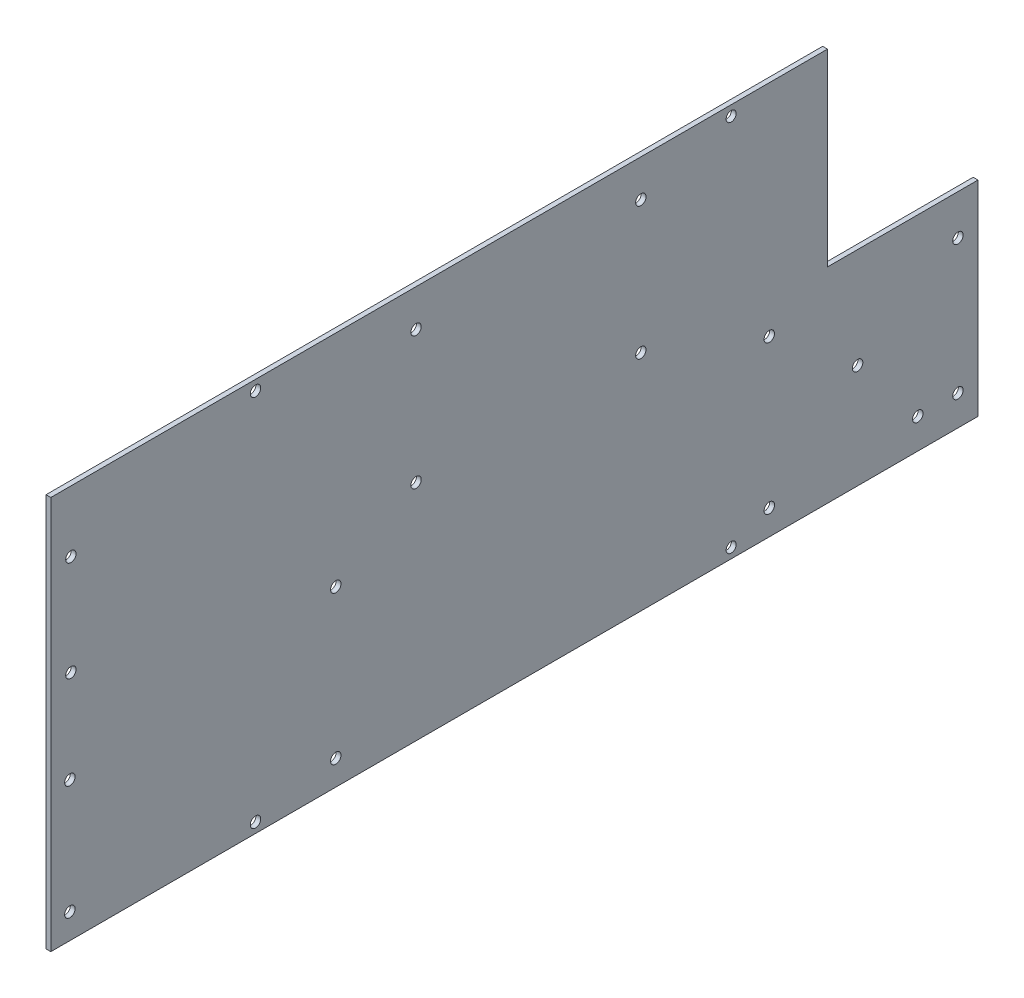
from build123d import *

# Parameters (mm, degrees)
SKETCH1_R          = 1.6383
SKETCH1_R_2        = 1.651
SKETCH1_R_3        = 1.5875
EXTRUDE1_DEPTH     = 1.524
SKETCH2_R          = 1.651
CUT_EXTRUDE1_DEPTH = 261.289404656


with BuildPart() as part:
    # Sketch1 → Extrude1 (new body)
    with BuildSketch(Plane(origin=(0, 0, 0), x_dir=(0, 0, -1), z_dir=(1, 0, 0))):
        Polygon((180.975, 124.46), (180.975, 64.77), (228.6, 64.77), (228.6, 0), (-64.77, 0), (-64.77, 124.46), align=None)
        with Locations(Location((121.92, 112.7125, 0), (0, 0, 180))):
            Circle(SKETCH1_R, mode=Mode.SUBTRACT)
        with Locations(Location((121.92, 70.8025, 0), (0, 0, 180))):
            Circle(SKETCH1_R, mode=Mode.SUBTRACT)
        with Locations(Location((-58.42, 73.3425, 0), (0, 0, 180))):
            Circle(SKETCH1_R, mode=Mode.SUBTRACT)
        with Locations(Location((-58.42, 105.0925, 0), (0, 0, 180))):
            Circle(SKETCH1_R, mode=Mode.SUBTRACT)
        with Locations(Location((50.8, 112.7125, 0), (0, 0, 180))):
            Circle(SKETCH1_R, mode=Mode.SUBTRACT)
        with Locations(Location((50.8, 70.8025, 0), (0, 0, 180))):
            Circle(SKETCH1_R, mode=Mode.SUBTRACT)
        with Locations(Location((162.56, 54.9275, 0), (0, 0, 180))):
            Circle(SKETCH1_R_2, mode=Mode.SUBTRACT)
        with Locations(Location((25.4, 54.9275, 0), (0, 0, 180))):
            Circle(SKETCH1_R_2, mode=Mode.SUBTRACT)
        with Locations(Location((25.4, 7.9375, 0), (0, 0, 180))):
            Circle(SKETCH1_R_2, mode=Mode.SUBTRACT)
        with Locations(Location((162.56, 7.9375, 0), (0, 0, 180))):
            Circle(SKETCH1_R_2, mode=Mode.SUBTRACT)
        with Locations(Location((-58.7375, 7.9375, 0), (0, 0, 180))):
            Circle(SKETCH1_R_2, mode=Mode.SUBTRACT)
        with Locations(Location((-58.7375, 44.11472, 0), (0, 0, 180))):
            Circle(SKETCH1_R_2, mode=Mode.SUBTRACT)
        with Locations(Location((0, 121.285, 0), (0, 0, 180))):
            Circle(SKETCH1_R_2, mode=Mode.SUBTRACT)
        with Locations(Location((0, 3.175, 0), (0, 0, 180))):
            Circle(SKETCH1_R_2, mode=Mode.SUBTRACT)
        with Locations(Location((190.5, 33.02, 0), (0, 0, 180))):
            Circle(SKETCH1_R_2, mode=Mode.SUBTRACT)
        with Locations(Location((222.25, 52.07, 0), (0, 0, 180))):
            Circle(SKETCH1_R_2, mode=Mode.SUBTRACT)
        with Locations(Location((150.495, 121.285, 0), (0, 0, 180))):
            Circle(SKETCH1_R_3, mode=Mode.SUBTRACT)
        with Locations(Location((150.495, 3.175, 0), (0, 0, 180))):
            Circle(SKETCH1_R_3, mode=Mode.SUBTRACT)
    extrude(amount=EXTRUDE1_DEPTH)

    # Sketch2 → Cut-Extrude1 (cut, through all)
    with BuildSketch(Plane(origin=(1.524, 0, 0), x_dir=(0, 0, -1), z_dir=(1, 0, 0))):
        with Locations((222.25, 9.55548)):
            Circle(SKETCH2_R)
        with Locations((209.55, 9.55548)):
            Circle(SKETCH2_R)
    extrude(amount=-CUT_EXTRUDE1_DEPTH, mode=Mode.SUBTRACT)


solid = part.part
